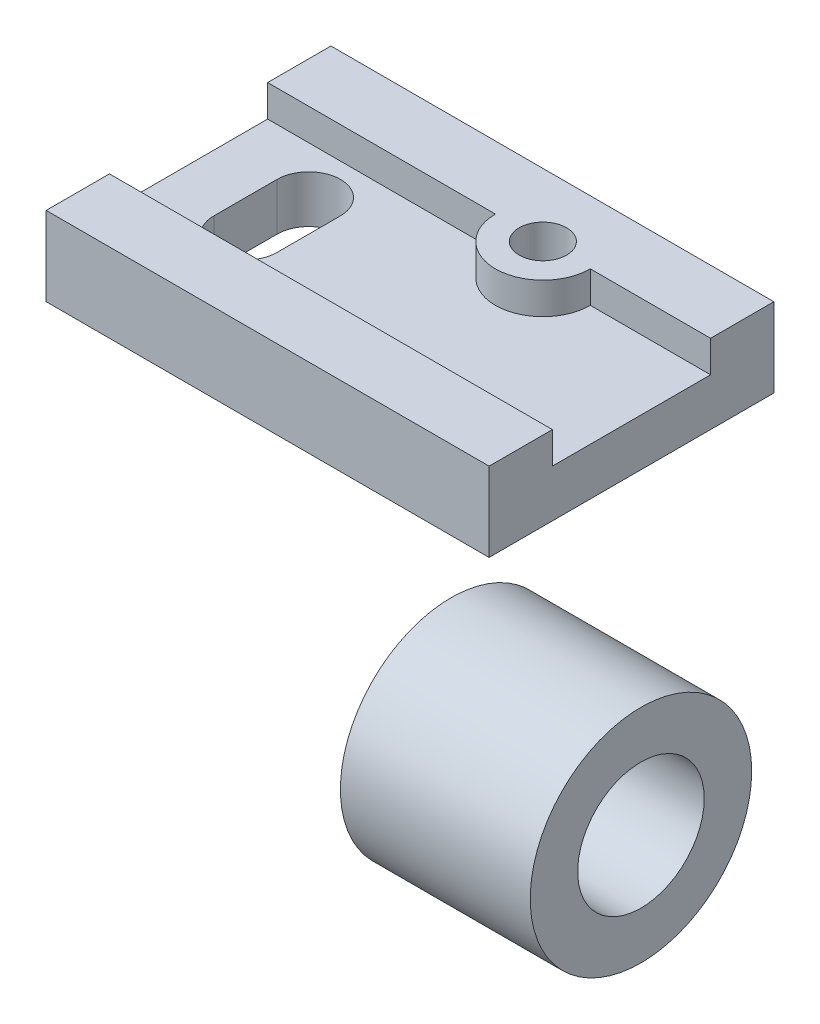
ISO-10303-21;
HEADER;
FILE_DESCRIPTION(('STEP AP214'),'2;1');
FILE_NAME('part.step','',(''),(''),'','','');
FILE_SCHEMA(('AUTOMOTIVE_DESIGN { 1 0 10303 214 1 1 1 1 }'));
ENDSEC;
DATA;
#1=APPLICATION_CONTEXT('core data for automotive mechanical design processes');
#2=APPLICATION_PROTOCOL_DEFINITION('international standard','automotive_design',2000,#1);
#3=PRODUCT_CONTEXT('',#1,'mechanical');
#4=PRODUCT('Part','Part','',(#3));
#5=PRODUCT_RELATED_PRODUCT_CATEGORY('part','',(#4));
#6=PRODUCT_DEFINITION_FORMATION('','',#4);
#7=PRODUCT_DEFINITION_CONTEXT('part definition',#1,'design');
#8=PRODUCT_DEFINITION('design','',#6,#7);
#9=PRODUCT_DEFINITION_SHAPE('','',#8);
#10=(LENGTH_UNIT() NAMED_UNIT(*) SI_UNIT(.MILLI.,.METRE.));
#11=(NAMED_UNIT(*) PLANE_ANGLE_UNIT() SI_UNIT($,.RADIAN.));
#12=(NAMED_UNIT(*) SI_UNIT($,.STERADIAN.) SOLID_ANGLE_UNIT());
#13=UNCERTAINTY_MEASURE_WITH_UNIT(LENGTH_MEASURE(1.E-05),#10,'distance_accuracy_value','');
#14=(GEOMETRIC_REPRESENTATION_CONTEXT(3) GLOBAL_UNCERTAINTY_ASSIGNED_CONTEXT((#13)) GLOBAL_UNIT_ASSIGNED_CONTEXT((#10,
#11,#12)) REPRESENTATION_CONTEXT('',''));
#15=CARTESIAN_POINT('',(0.,0.,0.));
#16=DIRECTION('',(0.,0.,1.));
#17=DIRECTION('',(1.,0.,0.));
#18=AXIS2_PLACEMENT_3D('',#15,#16,#17);
#19=CARTESIAN_POINT('',(20.,-80.,62.));
#20=DIRECTION('',(1.,0.,0.));
#21=DIRECTION('',(0.,0.,-1.));
#22=AXIS2_PLACEMENT_3D('',#19,#20,#21);
#23=PLANE('',#22);
#24=CARTESIAN_POINT('',(20.,-80.,62.));
#25=DIRECTION('',(1.,0.,0.));
#26=DIRECTION('',(0.,0.,-1.));
#27=AXIS2_PLACEMENT_3D('',#24,#25,#26);
#28=CIRCLE('',#27,35.);
#29=CARTESIAN_POINT('',(20.,-80.,27.));
#30=VERTEX_POINT('',#29);
#31=EDGE_CURVE('E11',#30,#30,#28,.T.);
#32=ORIENTED_EDGE('',*,*,#31,.T.);
#33=EDGE_LOOP('',(#32));
#34=FACE_BOUND('',#33,.T.);
#35=CARTESIAN_POINT('',(20.,-80.,62.));
#36=DIRECTION('',(1.,0.,0.));
#37=DIRECTION('',(0.,0.,-1.));
#38=AXIS2_PLACEMENT_3D('',#35,#36,#37);
#39=CIRCLE('',#38,20.);
#40=CARTESIAN_POINT('',(20.,-80.,42.));
#41=VERTEX_POINT('',#40);
#42=EDGE_CURVE('E50',#41,#41,#39,.T.);
#43=ORIENTED_EDGE('',*,*,#42,.F.);
#44=EDGE_LOOP('',(#43));
#45=FACE_BOUND('',#44,.T.);
#46=ADVANCED_FACE('F39',(#34,#45),#23,.T.);
#47=CARTESIAN_POINT('',(-40.,-80.,62.));
#48=DIRECTION('',(1.,0.,0.));
#49=DIRECTION('',(0.,0.,-1.));
#50=AXIS2_PLACEMENT_3D('',#47,#48,#49);
#51=PLANE('',#50);
#52=CARTESIAN_POINT('',(-40.,-80.,62.));
#53=DIRECTION('',(1.,0.,0.));
#54=DIRECTION('',(0.,0.,-1.));
#55=AXIS2_PLACEMENT_3D('',#52,#53,#54);
#56=CIRCLE('',#55,35.);
#57=CARTESIAN_POINT('',(-40.,-80.,27.));
#58=VERTEX_POINT('',#57);
#59=EDGE_CURVE('E43',#58,#58,#56,.T.);
#60=ORIENTED_EDGE('',*,*,#59,.F.);
#61=EDGE_LOOP('',(#60));
#62=FACE_BOUND('',#61,.T.);
#63=CARTESIAN_POINT('',(-40.,-80.,62.));
#64=DIRECTION('',(1.,0.,0.));
#65=DIRECTION('',(0.,0.,-1.));
#66=AXIS2_PLACEMENT_3D('',#63,#64,#65);
#67=CIRCLE('',#66,20.);
#68=CARTESIAN_POINT('',(-40.,-80.,42.));
#69=VERTEX_POINT('',#68);
#70=EDGE_CURVE('E52',#69,#69,#67,.T.);
#71=ORIENTED_EDGE('',*,*,#70,.T.);
#72=EDGE_LOOP('',(#71));
#73=FACE_BOUND('',#72,.T.);
#74=ADVANCED_FACE('F62',(#62,#73),#51,.F.);
#75=CARTESIAN_POINT('',(20.,-80.,62.));
#76=DIRECTION('',(-1.,0.,0.));
#77=DIRECTION('',(0.,0.,1.));
#78=AXIS2_PLACEMENT_3D('',#75,#76,#77);
#79=CYLINDRICAL_SURFACE('',#78,35.);
#80=ORIENTED_EDGE('',*,*,#31,.F.);
#81=EDGE_LOOP('',(#80));
#82=FACE_BOUND('',#81,.T.);
#83=ORIENTED_EDGE('',*,*,#59,.T.);
#84=EDGE_LOOP('',(#83));
#85=FACE_BOUND('',#84,.T.);
#86=ADVANCED_FACE('F41',(#82,#85),#79,.T.);
#87=CARTESIAN_POINT('',(20.,-80.,62.));
#88=DIRECTION('',(-1.,0.,0.));
#89=DIRECTION('',(0.,0.,1.));
#90=AXIS2_PLACEMENT_3D('',#87,#88,#89);
#91=CYLINDRICAL_SURFACE('',#90,20.);
#92=ORIENTED_EDGE('',*,*,#42,.T.);
#93=EDGE_LOOP('',(#92));
#94=FACE_BOUND('',#93,.T.);
#95=ORIENTED_EDGE('',*,*,#70,.F.);
#96=EDGE_LOOP('',(#95));
#97=FACE_BOUND('',#96,.T.);
#98=ADVANCED_FACE('F58',(#94,#97),#91,.F.);
#99=CLOSED_SHELL('',(#46,#74,#86,#98));
#100=MANIFOLD_SOLID_BREP('B2',#99);
#101=CARTESIAN_POINT('',(0.,25.,0.));
#102=DIRECTION('',(0.,-1.,0.));
#103=DIRECTION('',(0.,0.,-1.));
#104=AXIS2_PLACEMENT_3D('',#101,#102,#103);
#105=PLANE('',#104);
#106=CARTESIAN_POINT('',(-53.,25.,20.));
#107=DIRECTION('',(0.,1.,0.));
#108=DIRECTION('',(0.,0.,1.));
#109=AXIS2_PLACEMENT_3D('',#106,#107,#108);
#110=CIRCLE('',#109,7.5);
#111=CARTESIAN_POINT('',(-53.,25.,27.5));
#112=VERTEX_POINT('',#111);
#113=EDGE_CURVE('E235',#112,#112,#110,.T.);
#114=ORIENTED_EDGE('',*,*,#113,.F.);
#115=EDGE_LOOP('',(#114));
#116=FACE_BOUND('',#115,.T.);
#117=DIRECTION('',(0.,0.,1.));
#118=VECTOR('',#117,1.);
#119=CARTESIAN_POINT('',(-140.,25.,0.));
#120=LINE('',#119,#118);
#121=CARTESIAN_POINT('',(-140.,25.,0.));
#122=VERTEX_POINT('',#121);
#123=CARTESIAN_POINT('',(-140.,25.,20.));
#124=VERTEX_POINT('',#123);
#125=EDGE_CURVE('E294',#122,#124,#120,.T.);
#126=ORIENTED_EDGE('',*,*,#125,.T.);
#127=DIRECTION('',(-1.,0.,0.));
#128=VECTOR('',#127,1.);
#129=CARTESIAN_POINT('',(-140.,25.,20.));
#130=LINE('',#129,#128);
#131=CARTESIAN_POINT('',(-68.,25.,20.));
#132=VERTEX_POINT('',#131);
#133=EDGE_CURVE('E249',#132,#124,#130,.T.);
#134=ORIENTED_EDGE('',*,*,#133,.F.);
#135=CARTESIAN_POINT('',(-53.,25.,20.));
#136=DIRECTION('',(0.,-1.,0.));
#137=DIRECTION('',(0.,0.,1.));
#138=AXIS2_PLACEMENT_3D('',#135,#136,#137);
#139=CIRCLE('',#138,15.);
#140=CARTESIAN_POINT('',(-38.,25.,20.));
#141=VERTEX_POINT('',#140);
#142=EDGE_CURVE('E269',#141,#132,#139,.T.);
#143=ORIENTED_EDGE('',*,*,#142,.F.);
#144=DIRECTION('',(-1.,0.,0.));
#145=VECTOR('',#144,1.);
#146=CARTESIAN_POINT('',(-38.,25.,20.));
#147=LINE('',#146,#145);
#148=CARTESIAN_POINT('',(0.,25.,20.));
#149=VERTEX_POINT('',#148);
#150=EDGE_CURVE('E266',#149,#141,#147,.T.);
#151=ORIENTED_EDGE('',*,*,#150,.F.);
#152=DIRECTION('',(0.,0.,-1.));
#153=VECTOR('',#152,1.);
#154=CARTESIAN_POINT('',(0.,25.,0.));
#155=LINE('',#154,#153);
#156=CARTESIAN_POINT('',(0.,25.,0.));
#157=VERTEX_POINT('',#156);
#158=EDGE_CURVE('E291',#149,#157,#155,.T.);
#159=ORIENTED_EDGE('',*,*,#158,.T.);
#160=DIRECTION('',(-1.,0.,0.));
#161=VECTOR('',#160,1.);
#162=CARTESIAN_POINT('',(0.,25.,0.));
#163=LINE('',#162,#161);
#164=EDGE_CURVE('E290',#157,#122,#163,.T.);
#165=ORIENTED_EDGE('',*,*,#164,.T.);
#166=EDGE_LOOP('',(#126,#134,#143,#151,#159,#165));
#167=FACE_BOUND('',#166,.T.);
#168=ADVANCED_FACE('F101',(#116,#167),#105,.F.);
#169=CARTESIAN_POINT('',(0.,25.,0.));
#170=DIRECTION('',(-1.,0.,0.));
#171=DIRECTION('',(0.,0.,1.));
#172=AXIS2_PLACEMENT_3D('',#169,#170,#171);
#173=PLANE('',#172);
#174=ORIENTED_EDGE('',*,*,#158,.F.);
#175=DIRECTION('',(0.,1.,0.));
#176=VECTOR('',#175,1.);
#177=CARTESIAN_POINT('',(0.,15.,20.));
#178=LINE('',#177,#176);
#179=CARTESIAN_POINT('',(0.,15.,20.));
#180=VERTEX_POINT('',#179);
#181=EDGE_CURVE('E281',#180,#149,#178,.T.);
#182=ORIENTED_EDGE('',*,*,#181,.F.);
#183=DIRECTION('',(0.,0.,-1.));
#184=VECTOR('',#183,1.);
#185=CARTESIAN_POINT('',(0.,15.,20.));
#186=LINE('',#185,#184);
#187=CARTESIAN_POINT('',(0.,15.,70.));
#188=VERTEX_POINT('',#187);
#189=EDGE_CURVE('E252',#188,#180,#186,.T.);
#190=ORIENTED_EDGE('',*,*,#189,.F.);
#191=DIRECTION('',(0.,1.,0.));
#192=VECTOR('',#191,1.);
#193=CARTESIAN_POINT('',(0.,15.,70.));
#194=LINE('',#193,#192);
#195=CARTESIAN_POINT('',(0.,25.,70.));
#196=VERTEX_POINT('',#195);
#197=EDGE_CURVE('E283',#188,#196,#194,.T.);
#198=ORIENTED_EDGE('',*,*,#197,.T.);
#199=CARTESIAN_POINT('',(0.,25.,90.));
#200=VERTEX_POINT('',#199);
#201=EDGE_CURVE('E287',#200,#196,#155,.T.);
#202=ORIENTED_EDGE('',*,*,#201,.F.);
#203=DIRECTION('',(0.,-1.,0.));
#204=VECTOR('',#203,1.);
#205=CARTESIAN_POINT('',(0.,25.,90.));
#206=LINE('',#205,#204);
#207=CARTESIAN_POINT('',(0.,0.,90.));
#208=VERTEX_POINT('',#207);
#209=EDGE_CURVE('E299',#200,#208,#206,.T.);
#210=ORIENTED_EDGE('',*,*,#209,.T.);
#211=DIRECTION('',(0.,0.,-1.));
#212=VECTOR('',#211,1.);
#213=CARTESIAN_POINT('',(0.,0.,0.));
#214=LINE('',#213,#212);
#215=CARTESIAN_POINT('',(0.,0.,0.));
#216=VERTEX_POINT('',#215);
#217=EDGE_CURVE('E276',#208,#216,#214,.T.);
#218=ORIENTED_EDGE('',*,*,#217,.T.);
#219=DIRECTION('',(0.,-1.,0.));
#220=VECTOR('',#219,1.);
#221=CARTESIAN_POINT('',(0.,25.,0.));
#222=LINE('',#221,#220);
#223=EDGE_CURVE('E37',#157,#216,#222,.T.);
#224=ORIENTED_EDGE('',*,*,#223,.F.);
#225=EDGE_LOOP('',(#174,#182,#190,#198,#202,#210,#218,#224));
#226=FACE_BOUND('',#225,.T.);
#227=ADVANCED_FACE('F103',(#226),#173,.F.);
#228=CARTESIAN_POINT('',(0.,25.,0.));
#229=DIRECTION('',(0.,0.,1.));
#230=DIRECTION('',(1.,0.,0.));
#231=AXIS2_PLACEMENT_3D('',#228,#229,#230);
#232=PLANE('',#231);
#233=DIRECTION('',(-1.,0.,0.));
#234=VECTOR('',#233,1.);
#235=CARTESIAN_POINT('',(0.,0.,0.));
#236=LINE('',#235,#234);
#237=CARTESIAN_POINT('',(-140.,0.,0.));
#238=VERTEX_POINT('',#237);
#239=EDGE_CURVE('E302',#216,#238,#236,.T.);
#240=ORIENTED_EDGE('',*,*,#239,.T.);
#241=DIRECTION('',(0.,-1.,0.));
#242=VECTOR('',#241,1.);
#243=CARTESIAN_POINT('',(-140.,25.,0.));
#244=LINE('',#243,#242);
#245=EDGE_CURVE('E109',#122,#238,#244,.T.);
#246=ORIENTED_EDGE('',*,*,#245,.F.);
#247=ORIENTED_EDGE('',*,*,#164,.F.);
#248=ORIENTED_EDGE('',*,*,#223,.T.);
#249=EDGE_LOOP('',(#240,#246,#247,#248));
#250=FACE_BOUND('',#249,.T.);
#251=ADVANCED_FACE('F351',(#250),#232,.F.);
#252=CARTESIAN_POINT('',(-140.,25.,0.));
#253=DIRECTION('',(1.,0.,0.));
#254=DIRECTION('',(0.,0.,-1.));
#255=AXIS2_PLACEMENT_3D('',#252,#253,#254);
#256=PLANE('',#255);
#257=DIRECTION('',(0.,0.,1.));
#258=VECTOR('',#257,1.);
#259=CARTESIAN_POINT('',(-140.,15.,70.));
#260=LINE('',#259,#258);
#261=CARTESIAN_POINT('',(-140.,15.,20.));
#262=VERTEX_POINT('',#261);
#263=CARTESIAN_POINT('',(-140.,15.,70.));
#264=VERTEX_POINT('',#263);
#265=EDGE_CURVE('E245',#262,#264,#260,.T.);
#266=ORIENTED_EDGE('',*,*,#265,.F.);
#267=DIRECTION('',(0.,1.,0.));
#268=VECTOR('',#267,1.);
#269=CARTESIAN_POINT('',(-140.,15.,20.));
#270=LINE('',#269,#268);
#271=EDGE_CURVE('E273',#262,#124,#270,.T.);
#272=ORIENTED_EDGE('',*,*,#271,.T.);
#273=ORIENTED_EDGE('',*,*,#125,.F.);
#274=ORIENTED_EDGE('',*,*,#245,.T.);
#275=DIRECTION('',(0.,0.,1.));
#276=VECTOR('',#275,1.);
#277=CARTESIAN_POINT('',(-140.,0.,0.));
#278=LINE('',#277,#276);
#279=CARTESIAN_POINT('',(-140.,0.,90.));
#280=VERTEX_POINT('',#279);
#281=EDGE_CURVE('E304',#238,#280,#278,.T.);
#282=ORIENTED_EDGE('',*,*,#281,.T.);
#283=DIRECTION('',(0.,-1.,0.));
#284=VECTOR('',#283,1.);
#285=CARTESIAN_POINT('',(-140.,25.,90.));
#286=LINE('',#285,#284);
#287=CARTESIAN_POINT('',(-140.,25.,90.));
#288=VERTEX_POINT('',#287);
#289=EDGE_CURVE('E310',#288,#280,#286,.T.);
#290=ORIENTED_EDGE('',*,*,#289,.F.);
#291=CARTESIAN_POINT('',(-140.,25.,70.));
#292=VERTEX_POINT('',#291);
#293=EDGE_CURVE('E293',#292,#288,#120,.T.);
#294=ORIENTED_EDGE('',*,*,#293,.F.);
#295=DIRECTION('',(0.,1.,0.));
#296=VECTOR('',#295,1.);
#297=CARTESIAN_POINT('',(-140.,15.,70.));
#298=LINE('',#297,#296);
#299=EDGE_CURVE('E264',#264,#292,#298,.T.);
#300=ORIENTED_EDGE('',*,*,#299,.F.);
#301=EDGE_LOOP('',(#266,#272,#273,#274,#282,#290,#294,#300));
#302=FACE_BOUND('',#301,.T.);
#303=ADVANCED_FACE('F318',(#302),#256,.F.);
#304=CARTESIAN_POINT('',(0.,25.,90.));
#305=DIRECTION('',(0.,0.,-1.));
#306=DIRECTION('',(-1.,0.,0.));
#307=AXIS2_PLACEMENT_3D('',#304,#305,#306);
#308=PLANE('',#307);
#309=DIRECTION('',(1.,0.,0.));
#310=VECTOR('',#309,1.);
#311=CARTESIAN_POINT('',(0.,0.,90.));
#312=LINE('',#311,#310);
#313=EDGE_CURVE('E306',#280,#208,#312,.T.);
#314=ORIENTED_EDGE('',*,*,#313,.T.);
#315=ORIENTED_EDGE('',*,*,#209,.F.);
#316=DIRECTION('',(1.,0.,0.));
#317=VECTOR('',#316,1.);
#318=CARTESIAN_POINT('',(0.,25.,90.));
#319=LINE('',#318,#317);
#320=EDGE_CURVE('E297',#288,#200,#319,.T.);
#321=ORIENTED_EDGE('',*,*,#320,.F.);
#322=ORIENTED_EDGE('',*,*,#289,.T.);
#323=EDGE_LOOP('',(#314,#315,#321,#322));
#324=FACE_BOUND('',#323,.T.);
#325=ADVANCED_FACE('F327',(#324),#308,.F.);
#326=ORIENTED_EDGE('',*,*,#201,.T.);
#327=DIRECTION('',(1.,0.,0.));
#328=VECTOR('',#327,1.);
#329=CARTESIAN_POINT('',(0.,25.,70.));
#330=LINE('',#329,#328);
#331=EDGE_CURVE('E242',#292,#196,#330,.T.);
#332=ORIENTED_EDGE('',*,*,#331,.F.);
#333=ORIENTED_EDGE('',*,*,#293,.T.);
#334=ORIENTED_EDGE('',*,*,#320,.T.);
#335=EDGE_LOOP('',(#326,#332,#333,#334));
#336=FACE_BOUND('',#335,.T.);
#337=ADVANCED_FACE('F336',(#336),#105,.F.);
#338=CARTESIAN_POINT('',(0.,0.,0.));
#339=DIRECTION('',(0.,-1.,0.));
#340=DIRECTION('',(0.,0.,-1.));
#341=AXIS2_PLACEMENT_3D('',#338,#339,#340);
#342=PLANE('',#341);
#343=CARTESIAN_POINT('',(-112.,0.,35.));
#344=DIRECTION('',(0.,1.,0.));
#345=DIRECTION('',(0.,0.,1.));
#346=AXIS2_PLACEMENT_3D('',#343,#344,#345);
#347=CIRCLE('',#346,10.);
#348=CARTESIAN_POINT('',(-102.,0.,35.));
#349=VERTEX_POINT('',#348);
#350=CARTESIAN_POINT('',(-122.,0.,35.));
#351=VERTEX_POINT('',#350);
#352=EDGE_CURVE('E204',#349,#351,#347,.T.);
#353=ORIENTED_EDGE('',*,*,#352,.T.);
#354=DIRECTION('',(0.,0.,1.));
#355=VECTOR('',#354,1.);
#356=CARTESIAN_POINT('',(-122.,0.,35.));
#357=LINE('',#356,#355);
#358=CARTESIAN_POINT('',(-122.,0.,55.));
#359=VERTEX_POINT('',#358);
#360=EDGE_CURVE('E213',#351,#359,#357,.T.);
#361=ORIENTED_EDGE('',*,*,#360,.T.);
#362=CARTESIAN_POINT('',(-112.,0.,55.));
#363=DIRECTION('',(0.,1.,0.));
#364=DIRECTION('',(0.,0.,1.));
#365=AXIS2_PLACEMENT_3D('',#362,#363,#364);
#366=CIRCLE('',#365,10.);
#367=CARTESIAN_POINT('',(-102.,0.,55.));
#368=VERTEX_POINT('',#367);
#369=EDGE_CURVE('E116',#359,#368,#366,.T.);
#370=ORIENTED_EDGE('',*,*,#369,.T.);
#371=DIRECTION('',(0.,0.,-1.));
#372=VECTOR('',#371,1.);
#373=CARTESIAN_POINT('',(-102.,0.,55.));
#374=LINE('',#373,#372);
#375=EDGE_CURVE('E210',#368,#349,#374,.T.);
#376=ORIENTED_EDGE('',*,*,#375,.T.);
#377=EDGE_LOOP('',(#353,#361,#370,#376));
#378=FACE_BOUND('',#377,.T.);
#379=CARTESIAN_POINT('',(-53.,0.,20.));
#380=DIRECTION('',(0.,1.,0.));
#381=DIRECTION('',(0.,0.,1.));
#382=AXIS2_PLACEMENT_3D('',#379,#380,#381);
#383=CIRCLE('',#382,7.5);
#384=CARTESIAN_POINT('',(-53.,0.,27.5));
#385=VERTEX_POINT('',#384);
#386=EDGE_CURVE('E239',#385,#385,#383,.T.);
#387=ORIENTED_EDGE('',*,*,#386,.T.);
#388=EDGE_LOOP('',(#387));
#389=FACE_BOUND('',#388,.T.);
#390=ORIENTED_EDGE('',*,*,#217,.F.);
#391=ORIENTED_EDGE('',*,*,#313,.F.);
#392=ORIENTED_EDGE('',*,*,#281,.F.);
#393=ORIENTED_EDGE('',*,*,#239,.F.);
#394=EDGE_LOOP('',(#390,#391,#392,#393));
#395=FACE_BOUND('',#394,.T.);
#396=ADVANCED_FACE('F217',(#378,#389,#395),#342,.T.);
#397=CARTESIAN_POINT('',(-140.,15.,20.));
#398=DIRECTION('',(0.,0.,-1.));
#399=DIRECTION('',(-1.,0.,0.));
#400=AXIS2_PLACEMENT_3D('',#397,#398,#399);
#401=PLANE('',#400);
#402=ORIENTED_EDGE('',*,*,#133,.T.);
#403=ORIENTED_EDGE('',*,*,#271,.F.);
#404=DIRECTION('',(-1.,0.,0.));
#405=VECTOR('',#404,1.);
#406=CARTESIAN_POINT('',(-140.,15.,20.));
#407=LINE('',#406,#405);
#408=CARTESIAN_POINT('',(-68.,15.,20.));
#409=VERTEX_POINT('',#408);
#410=EDGE_CURVE('E261',#409,#262,#407,.T.);
#411=ORIENTED_EDGE('',*,*,#410,.F.);
#412=DIRECTION('',(0.,1.,0.));
#413=VECTOR('',#412,1.);
#414=CARTESIAN_POINT('',(-68.,15.,20.));
#415=LINE('',#414,#413);
#416=EDGE_CURVE('E277',#409,#132,#415,.T.);
#417=ORIENTED_EDGE('',*,*,#416,.T.);
#418=EDGE_LOOP('',(#402,#403,#411,#417));
#419=FACE_BOUND('',#418,.T.);
#420=ADVANCED_FACE('F346',(#419),#401,.F.);
#421=CARTESIAN_POINT('',(-53.,15.,20.));
#422=DIRECTION('',(0.,1.,0.));
#423=DIRECTION('',(0.,0.,1.));
#424=AXIS2_PLACEMENT_3D('',#421,#422,#423);
#425=CYLINDRICAL_SURFACE('',#424,15.);
#426=ORIENTED_EDGE('',*,*,#142,.T.);
#427=ORIENTED_EDGE('',*,*,#416,.F.);
#428=CARTESIAN_POINT('',(-53.,15.,20.));
#429=DIRECTION('',(0.,-1.,0.));
#430=DIRECTION('',(0.,0.,1.));
#431=AXIS2_PLACEMENT_3D('',#428,#429,#430);
#432=CIRCLE('',#431,15.);
#433=CARTESIAN_POINT('',(-38.,15.,20.));
#434=VERTEX_POINT('',#433);
#435=EDGE_CURVE('E258',#434,#409,#432,.T.);
#436=ORIENTED_EDGE('',*,*,#435,.F.);
#437=DIRECTION('',(0.,1.,0.));
#438=VECTOR('',#437,1.);
#439=CARTESIAN_POINT('',(-38.,15.,20.));
#440=LINE('',#439,#438);
#441=EDGE_CURVE('E279',#434,#141,#440,.T.);
#442=ORIENTED_EDGE('',*,*,#441,.T.);
#443=EDGE_LOOP('',(#426,#427,#436,#442));
#444=FACE_BOUND('',#443,.T.);
#445=ADVANCED_FACE('F356',(#444),#425,.T.);
#446=CARTESIAN_POINT('',(-38.,15.,20.));
#447=DIRECTION('',(0.,0.,-1.));
#448=DIRECTION('',(-1.,0.,0.));
#449=AXIS2_PLACEMENT_3D('',#446,#447,#448);
#450=PLANE('',#449);
#451=ORIENTED_EDGE('',*,*,#150,.T.);
#452=ORIENTED_EDGE('',*,*,#441,.F.);
#453=DIRECTION('',(-1.,0.,0.));
#454=VECTOR('',#453,1.);
#455=CARTESIAN_POINT('',(-38.,15.,20.));
#456=LINE('',#455,#454);
#457=EDGE_CURVE('E255',#180,#434,#456,.T.);
#458=ORIENTED_EDGE('',*,*,#457,.F.);
#459=ORIENTED_EDGE('',*,*,#181,.T.);
#460=EDGE_LOOP('',(#451,#452,#458,#459));
#461=FACE_BOUND('',#460,.T.);
#462=ADVANCED_FACE('F354',(#461),#450,.F.);
#463=CARTESIAN_POINT('',(0.,15.,70.));
#464=DIRECTION('',(0.,0.,1.));
#465=DIRECTION('',(1.,0.,0.));
#466=AXIS2_PLACEMENT_3D('',#463,#464,#465);
#467=PLANE('',#466);
#468=ORIENTED_EDGE('',*,*,#331,.T.);
#469=ORIENTED_EDGE('',*,*,#197,.F.);
#470=DIRECTION('',(1.,0.,0.));
#471=VECTOR('',#470,1.);
#472=CARTESIAN_POINT('',(0.,15.,70.));
#473=LINE('',#472,#471);
#474=EDGE_CURVE('E248',#264,#188,#473,.T.);
#475=ORIENTED_EDGE('',*,*,#474,.F.);
#476=ORIENTED_EDGE('',*,*,#299,.T.);
#477=EDGE_LOOP('',(#468,#469,#475,#476));
#478=FACE_BOUND('',#477,.T.);
#479=ADVANCED_FACE('F340',(#478),#467,.F.);
#480=CARTESIAN_POINT('',(-53.,15.,20.));
#481=DIRECTION('',(0.,1.,0.));
#482=DIRECTION('',(0.,0.,1.));
#483=AXIS2_PLACEMENT_3D('',#480,#481,#482);
#484=PLANE('',#483);
#485=CARTESIAN_POINT('',(-112.,15.,35.));
#486=DIRECTION('',(0.,1.,0.));
#487=DIRECTION('',(0.,0.,1.));
#488=AXIS2_PLACEMENT_3D('',#485,#486,#487);
#489=CIRCLE('',#488,10.);
#490=CARTESIAN_POINT('',(-102.,15.,35.));
#491=VERTEX_POINT('',#490);
#492=CARTESIAN_POINT('',(-122.,15.,35.));
#493=VERTEX_POINT('',#492);
#494=EDGE_CURVE('E124',#491,#493,#489,.T.);
#495=ORIENTED_EDGE('',*,*,#494,.F.);
#496=DIRECTION('',(0.,0.,-1.));
#497=VECTOR('',#496,1.);
#498=CARTESIAN_POINT('',(-102.,15.,55.));
#499=LINE('',#498,#497);
#500=CARTESIAN_POINT('',(-102.,15.,55.));
#501=VERTEX_POINT('',#500);
#502=EDGE_CURVE('E220',#501,#491,#499,.T.);
#503=ORIENTED_EDGE('',*,*,#502,.F.);
#504=CARTESIAN_POINT('',(-112.,15.,55.));
#505=DIRECTION('',(0.,1.,0.));
#506=DIRECTION('',(0.,0.,1.));
#507=AXIS2_PLACEMENT_3D('',#504,#505,#506);
#508=CIRCLE('',#507,10.);
#509=CARTESIAN_POINT('',(-122.,15.,55.));
#510=VERTEX_POINT('',#509);
#511=EDGE_CURVE('E223',#510,#501,#508,.T.);
#512=ORIENTED_EDGE('',*,*,#511,.F.);
#513=DIRECTION('',(0.,0.,1.));
#514=VECTOR('',#513,1.);
#515=CARTESIAN_POINT('',(-122.,15.,35.));
#516=LINE('',#515,#514);
#517=EDGE_CURVE('E229',#493,#510,#516,.T.);
#518=ORIENTED_EDGE('',*,*,#517,.F.);
#519=EDGE_LOOP('',(#495,#503,#512,#518));
#520=FACE_BOUND('',#519,.T.);
#521=ORIENTED_EDGE('',*,*,#265,.T.);
#522=ORIENTED_EDGE('',*,*,#474,.T.);
#523=ORIENTED_EDGE('',*,*,#189,.T.);
#524=ORIENTED_EDGE('',*,*,#457,.T.);
#525=ORIENTED_EDGE('',*,*,#435,.T.);
#526=ORIENTED_EDGE('',*,*,#410,.T.);
#527=EDGE_LOOP('',(#521,#522,#523,#524,#525,#526));
#528=FACE_BOUND('',#527,.T.);
#529=ADVANCED_FACE('F342',(#520,#528),#484,.T.);
#530=CARTESIAN_POINT('',(-53.,0.,20.));
#531=DIRECTION('',(0.,1.,0.));
#532=DIRECTION('',(0.,0.,1.));
#533=AXIS2_PLACEMENT_3D('',#530,#531,#532);
#534=CYLINDRICAL_SURFACE('',#533,7.5);
#535=ORIENTED_EDGE('',*,*,#386,.F.);
#536=EDGE_LOOP('',(#535));
#537=FACE_BOUND('',#536,.T.);
#538=ORIENTED_EDGE('',*,*,#113,.T.);
#539=EDGE_LOOP('',(#538));
#540=FACE_BOUND('',#539,.T.);
#541=ADVANCED_FACE('F435',(#537,#540),#534,.F.);
#542=CARTESIAN_POINT('',(-112.,0.,35.));
#543=DIRECTION('',(0.,1.,0.));
#544=DIRECTION('',(0.,0.,1.));
#545=AXIS2_PLACEMENT_3D('',#542,#543,#544);
#546=CYLINDRICAL_SURFACE('',#545,10.);
#547=ORIENTED_EDGE('',*,*,#494,.T.);
#548=DIRECTION('',(0.,1.,0.));
#549=VECTOR('',#548,1.);
#550=CARTESIAN_POINT('',(-122.,0.,35.));
#551=LINE('',#550,#549);
#552=EDGE_CURVE('E200',#351,#493,#551,.T.);
#553=ORIENTED_EDGE('',*,*,#552,.F.);
#554=ORIENTED_EDGE('',*,*,#352,.F.);
#555=DIRECTION('',(0.,1.,0.));
#556=VECTOR('',#555,1.);
#557=CARTESIAN_POINT('',(-102.,0.,35.));
#558=LINE('',#557,#556);
#559=EDGE_CURVE('E233',#349,#491,#558,.T.);
#560=ORIENTED_EDGE('',*,*,#559,.T.);
#561=EDGE_LOOP('',(#547,#553,#554,#560));
#562=FACE_BOUND('',#561,.T.);
#563=ADVANCED_FACE('F202',(#562),#546,.F.);
#564=CARTESIAN_POINT('',(-102.,0.,55.));
#565=DIRECTION('',(1.,0.,0.));
#566=DIRECTION('',(0.,0.,-1.));
#567=AXIS2_PLACEMENT_3D('',#564,#565,#566);
#568=PLANE('',#567);
#569=ORIENTED_EDGE('',*,*,#502,.T.);
#570=ORIENTED_EDGE('',*,*,#559,.F.);
#571=ORIENTED_EDGE('',*,*,#375,.F.);
#572=DIRECTION('',(0.,1.,0.));
#573=VECTOR('',#572,1.);
#574=CARTESIAN_POINT('',(-102.,0.,55.));
#575=LINE('',#574,#573);
#576=EDGE_CURVE('E236',#368,#501,#575,.T.);
#577=ORIENTED_EDGE('',*,*,#576,.T.);
#578=EDGE_LOOP('',(#569,#570,#571,#577));
#579=FACE_BOUND('',#578,.T.);
#580=ADVANCED_FACE('F461',(#579),#568,.F.);
#581=CARTESIAN_POINT('',(-112.,0.,55.));
#582=DIRECTION('',(0.,1.,0.));
#583=DIRECTION('',(0.,0.,1.));
#584=AXIS2_PLACEMENT_3D('',#581,#582,#583);
#585=CYLINDRICAL_SURFACE('',#584,10.);
#586=ORIENTED_EDGE('',*,*,#511,.T.);
#587=ORIENTED_EDGE('',*,*,#576,.F.);
#588=ORIENTED_EDGE('',*,*,#369,.F.);
#589=DIRECTION('',(0.,1.,0.));
#590=VECTOR('',#589,1.);
#591=CARTESIAN_POINT('',(-122.,0.,55.));
#592=LINE('',#591,#590);
#593=EDGE_CURVE('E209',#359,#510,#592,.T.);
#594=ORIENTED_EDGE('',*,*,#593,.T.);
#595=EDGE_LOOP('',(#586,#587,#588,#594));
#596=FACE_BOUND('',#595,.T.);
#597=ADVANCED_FACE('F470',(#596),#585,.F.);
#598=CARTESIAN_POINT('',(-122.,0.,35.));
#599=DIRECTION('',(-1.,0.,0.));
#600=DIRECTION('',(0.,0.,1.));
#601=AXIS2_PLACEMENT_3D('',#598,#599,#600);
#602=PLANE('',#601);
#603=ORIENTED_EDGE('',*,*,#517,.T.);
#604=ORIENTED_EDGE('',*,*,#593,.F.);
#605=ORIENTED_EDGE('',*,*,#360,.F.);
#606=ORIENTED_EDGE('',*,*,#552,.T.);
#607=EDGE_LOOP('',(#603,#604,#605,#606));
#608=FACE_BOUND('',#607,.T.);
#609=ADVANCED_FACE('F214',(#608),#602,.F.);
#610=CLOSED_SHELL('',(#168,#227,#251,#303,#325,#337,#396,#420,#445,#462,#479,#529,#541,#563,
#580,#597,#609));
#611=MANIFOLD_SOLID_BREP('B6',#610);
#612=ADVANCED_BREP_SHAPE_REPRESENTATION('',(#18,#100,#611),#14);
#613=SHAPE_DEFINITION_REPRESENTATION(#9,#612);
ENDSEC;
END-ISO-10303-21;
